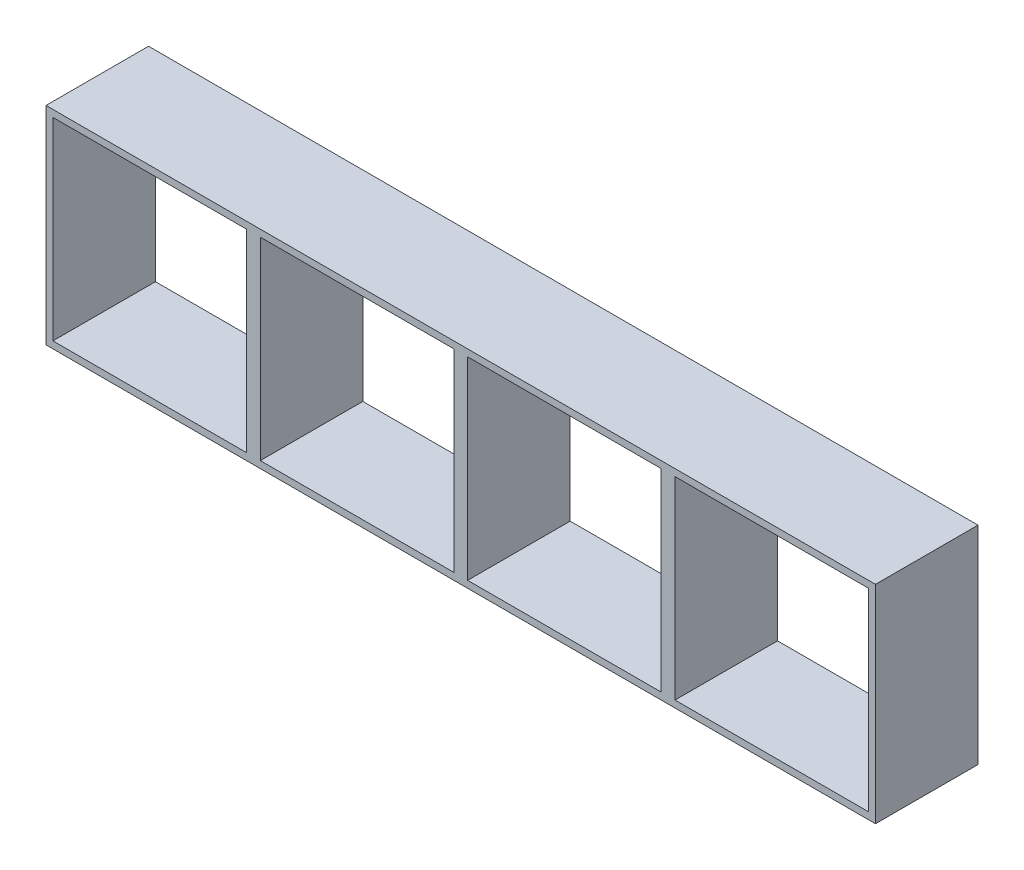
ISO-10303-21;
HEADER;
FILE_DESCRIPTION(('STEP AP214'),'2;1');
FILE_NAME('part.step','',(''),(''),'','','');
FILE_SCHEMA(('AUTOMOTIVE_DESIGN { 1 0 10303 214 1 1 1 1 }'));
ENDSEC;
DATA;
#1=APPLICATION_CONTEXT('core data for automotive mechanical design processes');
#2=APPLICATION_PROTOCOL_DEFINITION('international standard','automotive_design',2000,#1);
#3=PRODUCT_CONTEXT('',#1,'mechanical');
#4=PRODUCT('Part','Part','',(#3));
#5=PRODUCT_RELATED_PRODUCT_CATEGORY('part','',(#4));
#6=PRODUCT_DEFINITION_FORMATION('','',#4);
#7=PRODUCT_DEFINITION_CONTEXT('part definition',#1,'design');
#8=PRODUCT_DEFINITION('design','',#6,#7);
#9=PRODUCT_DEFINITION_SHAPE('','',#8);
#10=(LENGTH_UNIT() NAMED_UNIT(*) SI_UNIT(.MILLI.,.METRE.));
#11=(NAMED_UNIT(*) PLANE_ANGLE_UNIT() SI_UNIT($,.RADIAN.));
#12=(NAMED_UNIT(*) SI_UNIT($,.STERADIAN.) SOLID_ANGLE_UNIT());
#13=UNCERTAINTY_MEASURE_WITH_UNIT(LENGTH_MEASURE(1.E-05),#10,'distance_accuracy_value','');
#14=(GEOMETRIC_REPRESENTATION_CONTEXT(3) GLOBAL_UNCERTAINTY_ASSIGNED_CONTEXT((#13)) GLOBAL_UNIT_ASSIGNED_CONTEXT((#10,
#11,#12)) REPRESENTATION_CONTEXT('',''));
#15=CARTESIAN_POINT('',(0.,0.,0.));
#16=DIRECTION('',(0.,0.,1.));
#17=DIRECTION('',(1.,0.,0.));
#18=AXIS2_PLACEMENT_3D('',#15,#16,#17);
#19=CARTESIAN_POINT('',(0.,0.,14.8333333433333));
#20=DIRECTION('',(-1.,0.,0.));
#21=DIRECTION('',(0.,0.,1.));
#22=AXIS2_PLACEMENT_3D('',#19,#20,#21);
#23=PLANE('',#22);
#24=DIRECTION('',(0.,1.,0.));
#25=VECTOR('',#24,1.);
#26=CARTESIAN_POINT('',(0.,0.,0.));
#27=LINE('',#26,#25);
#28=CARTESIAN_POINT('',(0.,0.,0.));
#29=VERTEX_POINT('',#28);
#30=CARTESIAN_POINT('',(0.,30.,0.));
#31=VERTEX_POINT('',#30);
#32=EDGE_CURVE('E346',#29,#31,#27,.T.);
#33=ORIENTED_EDGE('',*,*,#32,.F.);
#34=DIRECTION('',(0.,0.,-1.));
#35=VECTOR('',#34,1.);
#36=CARTESIAN_POINT('',(0.,0.,14.8333333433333));
#37=LINE('',#36,#35);
#38=CARTESIAN_POINT('',(0.,0.,14.8333333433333));
#39=VERTEX_POINT('',#38);
#40=EDGE_CURVE('E11',#39,#29,#37,.T.);
#41=ORIENTED_EDGE('',*,*,#40,.F.);
#42=DIRECTION('',(0.,1.,0.));
#43=VECTOR('',#42,1.);
#44=CARTESIAN_POINT('',(0.,0.,14.8333333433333));
#45=LINE('',#44,#43);
#46=CARTESIAN_POINT('',(0.,30.,14.8333333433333));
#47=VERTEX_POINT('',#46);
#48=EDGE_CURVE('E206',#39,#47,#45,.T.);
#49=ORIENTED_EDGE('',*,*,#48,.T.);
#50=DIRECTION('',(0.,0.,-1.));
#51=VECTOR('',#50,1.);
#52=CARTESIAN_POINT('',(0.,30.,14.8333333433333));
#53=LINE('',#52,#51);
#54=EDGE_CURVE('E67',#47,#31,#53,.T.);
#55=ORIENTED_EDGE('',*,*,#54,.T.);
#56=EDGE_LOOP('',(#33,#41,#49,#55));
#57=FACE_BOUND('',#56,.T.);
#58=ADVANCED_FACE('F47',(#57),#23,.T.);
#59=CARTESIAN_POINT('',(0.,0.,14.8333333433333));
#60=DIRECTION('',(0.,1.,0.));
#61=DIRECTION('',(-1.,0.,0.));
#62=AXIS2_PLACEMENT_3D('',#59,#60,#61);
#63=PLANE('',#62);
#64=DIRECTION('',(1.,0.,0.));
#65=VECTOR('',#64,1.);
#66=CARTESIAN_POINT('',(0.,0.,0.));
#67=LINE('',#66,#65);
#68=CARTESIAN_POINT('',(120.,0.,0.));
#69=VERTEX_POINT('',#68);
#70=EDGE_CURVE('E212',#29,#69,#67,.T.);
#71=ORIENTED_EDGE('',*,*,#70,.T.);
#72=DIRECTION('',(0.,0.,-1.));
#73=VECTOR('',#72,1.);
#74=CARTESIAN_POINT('',(120.,0.,14.8333333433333));
#75=LINE('',#74,#73);
#76=CARTESIAN_POINT('',(120.,0.,14.8333333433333));
#77=VERTEX_POINT('',#76);
#78=EDGE_CURVE('E58',#77,#69,#75,.T.);
#79=ORIENTED_EDGE('',*,*,#78,.F.);
#80=DIRECTION('',(1.,0.,0.));
#81=VECTOR('',#80,1.);
#82=CARTESIAN_POINT('',(0.,0.,14.8333333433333));
#83=LINE('',#82,#81);
#84=EDGE_CURVE('E201',#39,#77,#83,.T.);
#85=ORIENTED_EDGE('',*,*,#84,.F.);
#86=ORIENTED_EDGE('',*,*,#40,.T.);
#87=EDGE_LOOP('',(#71,#79,#85,#86));
#88=FACE_BOUND('',#87,.T.);
#89=ADVANCED_FACE('F210',(#88),#63,.F.);
#90=CARTESIAN_POINT('',(120.,0.,14.8333333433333));
#91=DIRECTION('',(-1.,0.,0.));
#92=DIRECTION('',(0.,-1.,0.));
#93=AXIS2_PLACEMENT_3D('',#90,#91,#92);
#94=PLANE('',#93);
#95=DIRECTION('',(0.,1.,0.));
#96=VECTOR('',#95,1.);
#97=CARTESIAN_POINT('',(120.,0.,0.));
#98=LINE('',#97,#96);
#99=CARTESIAN_POINT('',(120.,30.,0.));
#100=VERTEX_POINT('',#99);
#101=EDGE_CURVE('E351',#69,#100,#98,.T.);
#102=ORIENTED_EDGE('',*,*,#101,.T.);
#103=DIRECTION('',(0.,0.,-1.));
#104=VECTOR('',#103,1.);
#105=CARTESIAN_POINT('',(120.,30.,14.8333333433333));
#106=LINE('',#105,#104);
#107=CARTESIAN_POINT('',(120.,30.,14.8333333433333));
#108=VERTEX_POINT('',#107);
#109=EDGE_CURVE('E129',#108,#100,#106,.T.);
#110=ORIENTED_EDGE('',*,*,#109,.F.);
#111=DIRECTION('',(0.,1.,0.));
#112=VECTOR('',#111,1.);
#113=CARTESIAN_POINT('',(120.,0.,14.8333333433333));
#114=LINE('',#113,#112);
#115=EDGE_CURVE('E192',#77,#108,#114,.T.);
#116=ORIENTED_EDGE('',*,*,#115,.F.);
#117=ORIENTED_EDGE('',*,*,#78,.T.);
#118=EDGE_LOOP('',(#102,#110,#116,#117));
#119=FACE_BOUND('',#118,.T.);
#120=ADVANCED_FACE('F194',(#119),#94,.F.);
#121=CARTESIAN_POINT('',(0.,1.,14.8333333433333));
#122=DIRECTION('',(0.,1.,0.));
#123=DIRECTION('',(0.,0.,1.));
#124=AXIS2_PLACEMENT_3D('',#121,#122,#123);
#125=PLANE('',#124);
#126=DIRECTION('',(1.,0.,0.));
#127=VECTOR('',#126,1.);
#128=CARTESIAN_POINT('',(0.,1.,0.));
#129=LINE('',#128,#127);
#130=CARTESIAN_POINT('',(1.,1.,0.));
#131=VERTEX_POINT('',#130);
#132=CARTESIAN_POINT('',(29.,1.,0.));
#133=VERTEX_POINT('',#132);
#134=EDGE_CURVE('E330',#131,#133,#129,.T.);
#135=ORIENTED_EDGE('',*,*,#134,.F.);
#136=DIRECTION('',(0.,0.,-1.));
#137=VECTOR('',#136,1.);
#138=CARTESIAN_POINT('',(1.,1.,14.8333333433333));
#139=LINE('',#138,#137);
#140=CARTESIAN_POINT('',(1.,1.,14.8333333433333));
#141=VERTEX_POINT('',#140);
#142=EDGE_CURVE('E229',#141,#131,#139,.T.);
#143=ORIENTED_EDGE('',*,*,#142,.F.);
#144=DIRECTION('',(1.,0.,0.));
#145=VECTOR('',#144,1.);
#146=CARTESIAN_POINT('',(0.,1.,14.8333333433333));
#147=LINE('',#146,#145);
#148=CARTESIAN_POINT('',(29.,1.,14.8333333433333));
#149=VERTEX_POINT('',#148);
#150=EDGE_CURVE('E403',#141,#149,#147,.T.);
#151=ORIENTED_EDGE('',*,*,#150,.T.);
#152=DIRECTION('',(0.,0.,-1.));
#153=VECTOR('',#152,1.);
#154=CARTESIAN_POINT('',(29.,1.,14.8333333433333));
#155=LINE('',#154,#153);
#156=EDGE_CURVE('E219',#149,#133,#155,.T.);
#157=ORIENTED_EDGE('',*,*,#156,.T.);
#158=EDGE_LOOP('',(#135,#143,#151,#157));
#159=FACE_BOUND('',#158,.T.);
#160=ADVANCED_FACE('F457',(#159),#125,.T.);
#161=CARTESIAN_POINT('',(1.,0.,14.8333333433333));
#162=DIRECTION('',(1.,0.,0.));
#163=DIRECTION('',(0.,1.,0.));
#164=AXIS2_PLACEMENT_3D('',#161,#162,#163);
#165=PLANE('',#164);
#166=DIRECTION('',(0.,-1.,0.));
#167=VECTOR('',#166,1.);
#168=CARTESIAN_POINT('',(1.,0.,0.));
#169=LINE('',#168,#167);
#170=CARTESIAN_POINT('',(1.,29.,0.));
#171=VERTEX_POINT('',#170);
#172=EDGE_CURVE('E334',#171,#131,#169,.T.);
#173=ORIENTED_EDGE('',*,*,#172,.F.);
#174=DIRECTION('',(0.,0.,-1.));
#175=VECTOR('',#174,1.);
#176=CARTESIAN_POINT('',(1.,29.,14.8333333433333));
#177=LINE('',#176,#175);
#178=CARTESIAN_POINT('',(1.,29.,14.8333333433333));
#179=VERTEX_POINT('',#178);
#180=EDGE_CURVE('E226',#179,#171,#177,.T.);
#181=ORIENTED_EDGE('',*,*,#180,.F.);
#182=DIRECTION('',(0.,-1.,0.));
#183=VECTOR('',#182,1.);
#184=CARTESIAN_POINT('',(1.,0.,14.8333333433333));
#185=LINE('',#184,#183);
#186=EDGE_CURVE('E407',#179,#141,#185,.T.);
#187=ORIENTED_EDGE('',*,*,#186,.T.);
#188=ORIENTED_EDGE('',*,*,#142,.T.);
#189=EDGE_LOOP('',(#173,#181,#187,#188));
#190=FACE_BOUND('',#189,.T.);
#191=ADVANCED_FACE('F453',(#190),#165,.T.);
#192=CARTESIAN_POINT('',(0.,29.,14.8333333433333));
#193=DIRECTION('',(0.,-1.,0.));
#194=DIRECTION('',(1.,0.,0.));
#195=AXIS2_PLACEMENT_3D('',#192,#193,#194);
#196=PLANE('',#195);
#197=DIRECTION('',(-1.,0.,0.));
#198=VECTOR('',#197,1.);
#199=CARTESIAN_POINT('',(0.,29.,0.));
#200=LINE('',#199,#198);
#201=CARTESIAN_POINT('',(29.,29.,0.));
#202=VERTEX_POINT('',#201);
#203=EDGE_CURVE('E338',#202,#171,#200,.T.);
#204=ORIENTED_EDGE('',*,*,#203,.F.);
#205=DIRECTION('',(0.,0.,-1.));
#206=VECTOR('',#205,1.);
#207=CARTESIAN_POINT('',(29.,29.,14.8333333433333));
#208=LINE('',#207,#206);
#209=CARTESIAN_POINT('',(29.,29.,14.8333333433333));
#210=VERTEX_POINT('',#209);
#211=EDGE_CURVE('E222',#210,#202,#208,.T.);
#212=ORIENTED_EDGE('',*,*,#211,.F.);
#213=DIRECTION('',(-1.,0.,0.));
#214=VECTOR('',#213,1.);
#215=CARTESIAN_POINT('',(0.,29.,14.8333333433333));
#216=LINE('',#215,#214);
#217=EDGE_CURVE('E411',#210,#179,#216,.T.);
#218=ORIENTED_EDGE('',*,*,#217,.T.);
#219=ORIENTED_EDGE('',*,*,#180,.T.);
#220=EDGE_LOOP('',(#204,#212,#218,#219));
#221=FACE_BOUND('',#220,.T.);
#222=ADVANCED_FACE('F449',(#221),#196,.T.);
#223=CARTESIAN_POINT('',(0.,0.999999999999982,14.8333333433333));
#224=DIRECTION('',(0.,1.,0.));
#225=DIRECTION('',(-1.,0.,0.));
#226=AXIS2_PLACEMENT_3D('',#223,#224,#225);
#227=PLANE('',#226);
#228=DIRECTION('',(1.,0.,0.));
#229=VECTOR('',#228,1.);
#230=CARTESIAN_POINT('',(0.,0.999999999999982,0.));
#231=LINE('',#230,#229);
#232=CARTESIAN_POINT('',(91.,1.00000000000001,0.));
#233=VERTEX_POINT('',#232);
#234=CARTESIAN_POINT('',(119.,1.00000000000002,0.));
#235=VERTEX_POINT('',#234);
#236=EDGE_CURVE('E314',#233,#235,#231,.T.);
#237=ORIENTED_EDGE('',*,*,#236,.F.);
#238=DIRECTION('',(0.,0.,-1.));
#239=VECTOR('',#238,1.);
#240=CARTESIAN_POINT('',(91.,1.00000000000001,14.8333333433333));
#241=LINE('',#240,#239);
#242=CARTESIAN_POINT('',(91.,1.00000000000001,14.8333333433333));
#243=VERTEX_POINT('',#242);
#244=EDGE_CURVE('E223',#243,#233,#241,.T.);
#245=ORIENTED_EDGE('',*,*,#244,.F.);
#246=DIRECTION('',(1.,0.,0.));
#247=VECTOR('',#246,1.);
#248=CARTESIAN_POINT('',(0.,0.999999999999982,14.8333333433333));
#249=LINE('',#248,#247);
#250=CARTESIAN_POINT('',(119.,1.00000000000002,14.8333333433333));
#251=VERTEX_POINT('',#250);
#252=EDGE_CURVE('E388',#243,#251,#249,.T.);
#253=ORIENTED_EDGE('',*,*,#252,.T.);
#254=DIRECTION('',(0.,0.,-1.));
#255=VECTOR('',#254,1.);
#256=CARTESIAN_POINT('',(119.,1.00000000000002,14.8333333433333));
#257=LINE('',#256,#255);
#258=EDGE_CURVE('E232',#251,#235,#257,.T.);
#259=ORIENTED_EDGE('',*,*,#258,.T.);
#260=EDGE_LOOP('',(#237,#245,#253,#259));
#261=FACE_BOUND('',#260,.T.);
#262=ADVANCED_FACE('F452',(#261),#227,.T.);
#263=CARTESIAN_POINT('',(91.,0.,14.8333333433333));
#264=DIRECTION('',(-1.,0.,0.));
#265=DIRECTION('',(0.,0.,1.));
#266=AXIS2_PLACEMENT_3D('',#263,#264,#265);
#267=PLANE('',#266);
#268=DIRECTION('',(0.,1.,0.));
#269=VECTOR('',#268,1.);
#270=CARTESIAN_POINT('',(91.,0.,0.));
#271=LINE('',#270,#269);
#272=CARTESIAN_POINT('',(91.,29.,0.));
#273=VERTEX_POINT('',#272);
#274=EDGE_CURVE('E318',#233,#273,#271,.T.);
#275=ORIENTED_EDGE('',*,*,#274,.T.);
#276=DIRECTION('',(0.,0.,-1.));
#277=VECTOR('',#276,1.);
#278=CARTESIAN_POINT('',(91.,29.,14.8333333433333));
#279=LINE('',#278,#277);
#280=CARTESIAN_POINT('',(91.,29.,14.8333333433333));
#281=VERTEX_POINT('',#280);
#282=EDGE_CURVE('E240',#281,#273,#279,.T.);
#283=ORIENTED_EDGE('',*,*,#282,.F.);
#284=DIRECTION('',(0.,1.,0.));
#285=VECTOR('',#284,1.);
#286=CARTESIAN_POINT('',(91.,0.,14.8333333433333));
#287=LINE('',#286,#285);
#288=EDGE_CURVE('E392',#243,#281,#287,.T.);
#289=ORIENTED_EDGE('',*,*,#288,.F.);
#290=ORIENTED_EDGE('',*,*,#244,.T.);
#291=EDGE_LOOP('',(#275,#283,#289,#290));
#292=FACE_BOUND('',#291,.T.);
#293=ADVANCED_FACE('F469',(#292),#267,.F.);
#294=CARTESIAN_POINT('',(0.,29.,14.8333333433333));
#295=DIRECTION('',(0.,1.,0.));
#296=DIRECTION('',(-1.,0.,0.));
#297=AXIS2_PLACEMENT_3D('',#294,#295,#296);
#298=PLANE('',#297);
#299=DIRECTION('',(1.,0.,0.));
#300=VECTOR('',#299,1.);
#301=CARTESIAN_POINT('',(0.,29.,0.));
#302=LINE('',#301,#300);
#303=CARTESIAN_POINT('',(119.,29.,0.));
#304=VERTEX_POINT('',#303);
#305=EDGE_CURVE('E322',#273,#304,#302,.T.);
#306=ORIENTED_EDGE('',*,*,#305,.T.);
#307=DIRECTION('',(0.,0.,-1.));
#308=VECTOR('',#307,1.);
#309=CARTESIAN_POINT('',(119.,29.,14.8333333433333));
#310=LINE('',#309,#308);
#311=CARTESIAN_POINT('',(119.,29.,14.8333333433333));
#312=VERTEX_POINT('',#311);
#313=EDGE_CURVE('E235',#312,#304,#310,.T.);
#314=ORIENTED_EDGE('',*,*,#313,.F.);
#315=DIRECTION('',(1.,0.,0.));
#316=VECTOR('',#315,1.);
#317=CARTESIAN_POINT('',(0.,29.,14.8333333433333));
#318=LINE('',#317,#316);
#319=EDGE_CURVE('E396',#281,#312,#318,.T.);
#320=ORIENTED_EDGE('',*,*,#319,.F.);
#321=ORIENTED_EDGE('',*,*,#282,.T.);
#322=EDGE_LOOP('',(#306,#314,#320,#321));
#323=FACE_BOUND('',#322,.T.);
#324=ADVANCED_FACE('F465',(#323),#298,.F.);
#325=CARTESIAN_POINT('',(0.,0.999999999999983,14.8333333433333));
#326=DIRECTION('',(0.,1.,0.));
#327=DIRECTION('',(-1.,0.,0.));
#328=AXIS2_PLACEMENT_3D('',#325,#326,#327);
#329=PLANE('',#328);
#330=DIRECTION('',(1.,0.,0.));
#331=VECTOR('',#330,1.);
#332=CARTESIAN_POINT('',(0.,0.999999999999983,0.));
#333=LINE('',#332,#331);
#334=CARTESIAN_POINT('',(61.,1.,0.));
#335=VERTEX_POINT('',#334);
#336=CARTESIAN_POINT('',(89.,1.00000000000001,0.));
#337=VERTEX_POINT('',#336);
#338=EDGE_CURVE('E298',#335,#337,#333,.T.);
#339=ORIENTED_EDGE('',*,*,#338,.F.);
#340=DIRECTION('',(0.,0.,-1.));
#341=VECTOR('',#340,1.);
#342=CARTESIAN_POINT('',(61.,1.,14.8333333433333));
#343=LINE('',#342,#341);
#344=CARTESIAN_POINT('',(61.,1.,14.8333333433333));
#345=VERTEX_POINT('',#344);
#346=EDGE_CURVE('E236',#345,#335,#343,.T.);
#347=ORIENTED_EDGE('',*,*,#346,.F.);
#348=DIRECTION('',(1.,0.,0.));
#349=VECTOR('',#348,1.);
#350=CARTESIAN_POINT('',(0.,0.999999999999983,14.8333333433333));
#351=LINE('',#350,#349);
#352=CARTESIAN_POINT('',(89.,1.00000000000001,14.8333333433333));
#353=VERTEX_POINT('',#352);
#354=EDGE_CURVE('E373',#345,#353,#351,.T.);
#355=ORIENTED_EDGE('',*,*,#354,.T.);
#356=DIRECTION('',(0.,0.,-1.));
#357=VECTOR('',#356,1.);
#358=CARTESIAN_POINT('',(89.,1.00000000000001,14.8333333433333));
#359=LINE('',#358,#357);
#360=EDGE_CURVE('E246',#353,#337,#359,.T.);
#361=ORIENTED_EDGE('',*,*,#360,.T.);
#362=EDGE_LOOP('',(#339,#347,#355,#361));
#363=FACE_BOUND('',#362,.T.);
#364=ADVANCED_FACE('F468',(#363),#329,.T.);
#365=CARTESIAN_POINT('',(61.,0.,14.8333333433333));
#366=DIRECTION('',(-1.,0.,0.));
#367=DIRECTION('',(0.,-1.,0.));
#368=AXIS2_PLACEMENT_3D('',#365,#366,#367);
#369=PLANE('',#368);
#370=DIRECTION('',(0.,1.,0.));
#371=VECTOR('',#370,1.);
#372=CARTESIAN_POINT('',(61.,0.,0.));
#373=LINE('',#372,#371);
#374=CARTESIAN_POINT('',(61.,29.,0.));
#375=VERTEX_POINT('',#374);
#376=EDGE_CURVE('E302',#335,#375,#373,.T.);
#377=ORIENTED_EDGE('',*,*,#376,.T.);
#378=DIRECTION('',(0.,0.,-1.));
#379=VECTOR('',#378,1.);
#380=CARTESIAN_POINT('',(61.,29.,14.8333333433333));
#381=LINE('',#380,#379);
#382=CARTESIAN_POINT('',(61.,29.,14.8333333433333));
#383=VERTEX_POINT('',#382);
#384=EDGE_CURVE('E253',#383,#375,#381,.T.);
#385=ORIENTED_EDGE('',*,*,#384,.F.);
#386=DIRECTION('',(0.,1.,0.));
#387=VECTOR('',#386,1.);
#388=CARTESIAN_POINT('',(61.,0.,14.8333333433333));
#389=LINE('',#388,#387);
#390=EDGE_CURVE('E377',#345,#383,#389,.T.);
#391=ORIENTED_EDGE('',*,*,#390,.F.);
#392=ORIENTED_EDGE('',*,*,#346,.T.);
#393=EDGE_LOOP('',(#377,#385,#391,#392));
#394=FACE_BOUND('',#393,.T.);
#395=ADVANCED_FACE('F483',(#394),#369,.F.);
#396=CARTESIAN_POINT('',(0.,29.,14.8333333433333));
#397=DIRECTION('',(0.,1.,0.));
#398=DIRECTION('',(0.,0.,1.));
#399=AXIS2_PLACEMENT_3D('',#396,#397,#398);
#400=PLANE('',#399);
#401=DIRECTION('',(1.,0.,0.));
#402=VECTOR('',#401,1.);
#403=CARTESIAN_POINT('',(0.,29.,0.));
#404=LINE('',#403,#402);
#405=CARTESIAN_POINT('',(89.,29.,0.));
#406=VERTEX_POINT('',#405);
#407=EDGE_CURVE('E306',#375,#406,#404,.T.);
#408=ORIENTED_EDGE('',*,*,#407,.T.);
#409=DIRECTION('',(0.,0.,-1.));
#410=VECTOR('',#409,1.);
#411=CARTESIAN_POINT('',(89.,29.,14.8333333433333));
#412=LINE('',#411,#410);
#413=CARTESIAN_POINT('',(89.,29.,14.8333333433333));
#414=VERTEX_POINT('',#413);
#415=EDGE_CURVE('E249',#414,#406,#412,.T.);
#416=ORIENTED_EDGE('',*,*,#415,.F.);
#417=DIRECTION('',(1.,0.,0.));
#418=VECTOR('',#417,1.);
#419=CARTESIAN_POINT('',(0.,29.,14.8333333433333));
#420=LINE('',#419,#418);
#421=EDGE_CURVE('E381',#383,#414,#420,.T.);
#422=ORIENTED_EDGE('',*,*,#421,.F.);
#423=ORIENTED_EDGE('',*,*,#384,.T.);
#424=EDGE_LOOP('',(#408,#416,#422,#423));
#425=FACE_BOUND('',#424,.T.);
#426=ADVANCED_FACE('F480',(#425),#400,.F.);
#427=CARTESIAN_POINT('',(0.,1.,14.8333333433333));
#428=DIRECTION('',(0.,1.,0.));
#429=DIRECTION('',(-1.,0.,0.));
#430=AXIS2_PLACEMENT_3D('',#427,#428,#429);
#431=PLANE('',#430);
#432=DIRECTION('',(1.,0.,0.));
#433=VECTOR('',#432,1.);
#434=CARTESIAN_POINT('',(0.,1.,0.));
#435=LINE('',#434,#433);
#436=CARTESIAN_POINT('',(31.,1.,0.));
#437=VERTEX_POINT('',#436);
#438=CARTESIAN_POINT('',(59.,1.,0.));
#439=VERTEX_POINT('',#438);
#440=EDGE_CURVE('E280',#437,#439,#435,.T.);
#441=ORIENTED_EDGE('',*,*,#440,.F.);
#442=DIRECTION('',(0.,0.,-1.));
#443=VECTOR('',#442,1.);
#444=CARTESIAN_POINT('',(31.,1.,14.8333333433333));
#445=LINE('',#444,#443);
#446=CARTESIAN_POINT('',(31.,1.,14.8333333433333));
#447=VERTEX_POINT('',#446);
#448=EDGE_CURVE('E51',#447,#437,#445,.T.);
#449=ORIENTED_EDGE('',*,*,#448,.F.);
#450=DIRECTION('',(1.,0.,0.));
#451=VECTOR('',#450,1.);
#452=CARTESIAN_POINT('',(0.,1.,14.8333333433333));
#453=LINE('',#452,#451);
#454=CARTESIAN_POINT('',(59.,1.,14.8333333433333));
#455=VERTEX_POINT('',#454);
#456=EDGE_CURVE('E357',#447,#455,#453,.T.);
#457=ORIENTED_EDGE('',*,*,#456,.T.);
#458=DIRECTION('',(0.,0.,-1.));
#459=VECTOR('',#458,1.);
#460=CARTESIAN_POINT('',(59.,1.,14.8333333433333));
#461=LINE('',#460,#459);
#462=EDGE_CURVE('E259',#455,#439,#461,.T.);
#463=ORIENTED_EDGE('',*,*,#462,.T.);
#464=EDGE_LOOP('',(#441,#449,#457,#463));
#465=FACE_BOUND('',#464,.T.);
#466=ADVANCED_FACE('F49',(#465),#431,.T.);
#467=CARTESIAN_POINT('',(31.,0.,14.8333333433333));
#468=DIRECTION('',(1.,0.,0.));
#469=DIRECTION('',(0.,1.,0.));
#470=AXIS2_PLACEMENT_3D('',#467,#468,#469);
#471=PLANE('',#470);
#472=DIRECTION('',(0.,-1.,0.));
#473=VECTOR('',#472,1.);
#474=CARTESIAN_POINT('',(31.,0.,0.));
#475=LINE('',#474,#473);
#476=CARTESIAN_POINT('',(31.,29.,0.));
#477=VERTEX_POINT('',#476);
#478=EDGE_CURVE('E275',#477,#437,#475,.T.);
#479=ORIENTED_EDGE('',*,*,#478,.F.);
#480=DIRECTION('',(0.,0.,-1.));
#481=VECTOR('',#480,1.);
#482=CARTESIAN_POINT('',(31.,29.,14.8333333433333));
#483=LINE('',#482,#481);
#484=CARTESIAN_POINT('',(31.,29.,14.8333333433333));
#485=VERTEX_POINT('',#484);
#486=EDGE_CURVE('E264',#485,#477,#483,.T.);
#487=ORIENTED_EDGE('',*,*,#486,.F.);
#488=DIRECTION('',(0.,-1.,0.));
#489=VECTOR('',#488,1.);
#490=CARTESIAN_POINT('',(31.,0.,14.8333333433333));
#491=LINE('',#490,#489);
#492=EDGE_CURVE('E278',#485,#447,#491,.T.);
#493=ORIENTED_EDGE('',*,*,#492,.T.);
#494=ORIENTED_EDGE('',*,*,#448,.T.);
#495=EDGE_LOOP('',(#479,#487,#493,#494));
#496=FACE_BOUND('',#495,.T.);
#497=ADVANCED_FACE('F273',(#496),#471,.T.);
#498=CARTESIAN_POINT('',(0.,29.,14.8333333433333));
#499=DIRECTION('',(0.,-1.,0.));
#500=DIRECTION('',(1.,0.,0.));
#501=AXIS2_PLACEMENT_3D('',#498,#499,#500);
#502=PLANE('',#501);
#503=DIRECTION('',(-1.,0.,0.));
#504=VECTOR('',#503,1.);
#505=CARTESIAN_POINT('',(0.,29.,0.));
#506=LINE('',#505,#504);
#507=CARTESIAN_POINT('',(59.,29.,0.));
#508=VERTEX_POINT('',#507);
#509=EDGE_CURVE('E288',#508,#477,#506,.T.);
#510=ORIENTED_EDGE('',*,*,#509,.F.);
#511=DIRECTION('',(0.,0.,-1.));
#512=VECTOR('',#511,1.);
#513=CARTESIAN_POINT('',(59.,29.,14.8333333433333));
#514=LINE('',#513,#512);
#515=CARTESIAN_POINT('',(59.,29.,14.8333333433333));
#516=VERTEX_POINT('',#515);
#517=EDGE_CURVE('E262',#516,#508,#514,.T.);
#518=ORIENTED_EDGE('',*,*,#517,.F.);
#519=DIRECTION('',(-1.,0.,0.));
#520=VECTOR('',#519,1.);
#521=CARTESIAN_POINT('',(0.,29.,14.8333333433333));
#522=LINE('',#521,#520);
#523=EDGE_CURVE('E364',#516,#485,#522,.T.);
#524=ORIENTED_EDGE('',*,*,#523,.T.);
#525=ORIENTED_EDGE('',*,*,#486,.T.);
#526=EDGE_LOOP('',(#510,#518,#524,#525));
#527=FACE_BOUND('',#526,.T.);
#528=ADVANCED_FACE('F447',(#527),#502,.T.);
#529=CARTESIAN_POINT('',(29.,0.,14.8333333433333));
#530=DIRECTION('',(-1.,0.,0.));
#531=DIRECTION('',(0.,0.,1.));
#532=AXIS2_PLACEMENT_3D('',#529,#530,#531);
#533=PLANE('',#532);
#534=DIRECTION('',(0.,1.,0.));
#535=VECTOR('',#534,1.);
#536=CARTESIAN_POINT('',(29.,0.,0.));
#537=LINE('',#536,#535);
#538=EDGE_CURVE('E342',#133,#202,#537,.T.);
#539=ORIENTED_EDGE('',*,*,#538,.F.);
#540=ORIENTED_EDGE('',*,*,#156,.F.);
#541=DIRECTION('',(0.,1.,0.));
#542=VECTOR('',#541,1.);
#543=CARTESIAN_POINT('',(29.,0.,14.8333333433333));
#544=LINE('',#543,#542);
#545=EDGE_CURVE('E415',#149,#210,#544,.T.);
#546=ORIENTED_EDGE('',*,*,#545,.T.);
#547=ORIENTED_EDGE('',*,*,#211,.T.);
#548=EDGE_LOOP('',(#539,#540,#546,#547));
#549=FACE_BOUND('',#548,.T.);
#550=ADVANCED_FACE('F443',(#549),#533,.T.);
#551=CARTESIAN_POINT('',(119.,0.,14.8333333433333));
#552=DIRECTION('',(1.,0.,0.));
#553=DIRECTION('',(0.,1.,0.));
#554=AXIS2_PLACEMENT_3D('',#551,#552,#553);
#555=PLANE('',#554);
#556=DIRECTION('',(0.,-1.,0.));
#557=VECTOR('',#556,1.);
#558=CARTESIAN_POINT('',(119.,0.,0.));
#559=LINE('',#558,#557);
#560=EDGE_CURVE('E326',#304,#235,#559,.T.);
#561=ORIENTED_EDGE('',*,*,#560,.T.);
#562=ORIENTED_EDGE('',*,*,#258,.F.);
#563=DIRECTION('',(0.,-1.,0.));
#564=VECTOR('',#563,1.);
#565=CARTESIAN_POINT('',(119.,0.,14.8333333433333));
#566=LINE('',#565,#564);
#567=EDGE_CURVE('E400',#312,#251,#566,.T.);
#568=ORIENTED_EDGE('',*,*,#567,.F.);
#569=ORIENTED_EDGE('',*,*,#313,.T.);
#570=EDGE_LOOP('',(#561,#562,#568,#569));
#571=FACE_BOUND('',#570,.T.);
#572=ADVANCED_FACE('F446',(#571),#555,.F.);
#573=CARTESIAN_POINT('',(89.,0.,14.8333333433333));
#574=DIRECTION('',(1.,0.,0.));
#575=DIRECTION('',(0.,0.,-1.));
#576=AXIS2_PLACEMENT_3D('',#573,#574,#575);
#577=PLANE('',#576);
#578=DIRECTION('',(0.,-1.,0.));
#579=VECTOR('',#578,1.);
#580=CARTESIAN_POINT('',(89.,0.,0.));
#581=LINE('',#580,#579);
#582=EDGE_CURVE('E310',#406,#337,#581,.T.);
#583=ORIENTED_EDGE('',*,*,#582,.T.);
#584=ORIENTED_EDGE('',*,*,#360,.F.);
#585=DIRECTION('',(0.,-1.,0.));
#586=VECTOR('',#585,1.);
#587=CARTESIAN_POINT('',(89.,0.,14.8333333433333));
#588=LINE('',#587,#586);
#589=EDGE_CURVE('E385',#414,#353,#588,.T.);
#590=ORIENTED_EDGE('',*,*,#589,.F.);
#591=ORIENTED_EDGE('',*,*,#415,.T.);
#592=EDGE_LOOP('',(#583,#584,#590,#591));
#593=FACE_BOUND('',#592,.T.);
#594=ADVANCED_FACE('F431',(#593),#577,.F.);
#595=CARTESIAN_POINT('',(59.,0.,14.8333333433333));
#596=DIRECTION('',(-1.,0.,0.));
#597=DIRECTION('',(0.,0.,1.));
#598=AXIS2_PLACEMENT_3D('',#595,#596,#597);
#599=PLANE('',#598);
#600=DIRECTION('',(0.,1.,0.));
#601=VECTOR('',#600,1.);
#602=CARTESIAN_POINT('',(59.,0.,0.));
#603=LINE('',#602,#601);
#604=EDGE_CURVE('E292',#439,#508,#603,.T.);
#605=ORIENTED_EDGE('',*,*,#604,.F.);
#606=ORIENTED_EDGE('',*,*,#462,.F.);
#607=DIRECTION('',(0.,1.,0.));
#608=VECTOR('',#607,1.);
#609=CARTESIAN_POINT('',(59.,0.,14.8333333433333));
#610=LINE('',#609,#608);
#611=EDGE_CURVE('E369',#455,#516,#610,.T.);
#612=ORIENTED_EDGE('',*,*,#611,.T.);
#613=ORIENTED_EDGE('',*,*,#517,.T.);
#614=EDGE_LOOP('',(#605,#606,#612,#613));
#615=FACE_BOUND('',#614,.T.);
#616=ADVANCED_FACE('F423',(#615),#599,.T.);
#617=CARTESIAN_POINT('',(0.,30.,14.8333333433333));
#618=DIRECTION('',(0.,1.,0.));
#619=DIRECTION('',(-1.,0.,0.));
#620=AXIS2_PLACEMENT_3D('',#617,#618,#619);
#621=PLANE('',#620);
#622=DIRECTION('',(1.,0.,0.));
#623=VECTOR('',#622,1.);
#624=CARTESIAN_POINT('',(0.,30.,0.));
#625=LINE('',#624,#623);
#626=EDGE_CURVE('E354',#31,#100,#625,.T.);
#627=ORIENTED_EDGE('',*,*,#626,.F.);
#628=ORIENTED_EDGE('',*,*,#54,.F.);
#629=DIRECTION('',(1.,0.,0.));
#630=VECTOR('',#629,1.);
#631=CARTESIAN_POINT('',(0.,30.,14.8333333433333));
#632=LINE('',#631,#630);
#633=EDGE_CURVE('E200',#47,#108,#632,.T.);
#634=ORIENTED_EDGE('',*,*,#633,.T.);
#635=ORIENTED_EDGE('',*,*,#109,.T.);
#636=EDGE_LOOP('',(#627,#628,#634,#635));
#637=FACE_BOUND('',#636,.T.);
#638=ADVANCED_FACE('F421',(#637),#621,.T.);
#639=CARTESIAN_POINT('',(0.,0.,14.8333333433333));
#640=DIRECTION('',(0.,0.,1.));
#641=DIRECTION('',(1.,0.,0.));
#642=AXIS2_PLACEMENT_3D('',#639,#640,#641);
#643=PLANE('',#642);
#644=ORIENTED_EDGE('',*,*,#456,.F.);
#645=ORIENTED_EDGE('',*,*,#492,.F.);
#646=ORIENTED_EDGE('',*,*,#523,.F.);
#647=ORIENTED_EDGE('',*,*,#611,.F.);
#648=EDGE_LOOP('',(#644,#645,#646,#647));
#649=FACE_BOUND('',#648,.T.);
#650=ORIENTED_EDGE('',*,*,#354,.F.);
#651=ORIENTED_EDGE('',*,*,#390,.T.);
#652=ORIENTED_EDGE('',*,*,#421,.T.);
#653=ORIENTED_EDGE('',*,*,#589,.T.);
#654=EDGE_LOOP('',(#650,#651,#652,#653));
#655=FACE_BOUND('',#654,.T.);
#656=ORIENTED_EDGE('',*,*,#252,.F.);
#657=ORIENTED_EDGE('',*,*,#288,.T.);
#658=ORIENTED_EDGE('',*,*,#319,.T.);
#659=ORIENTED_EDGE('',*,*,#567,.T.);
#660=EDGE_LOOP('',(#656,#657,#658,#659));
#661=FACE_BOUND('',#660,.T.);
#662=ORIENTED_EDGE('',*,*,#150,.F.);
#663=ORIENTED_EDGE('',*,*,#186,.F.);
#664=ORIENTED_EDGE('',*,*,#217,.F.);
#665=ORIENTED_EDGE('',*,*,#545,.F.);
#666=EDGE_LOOP('',(#662,#663,#664,#665));
#667=FACE_BOUND('',#666,.T.);
#668=ORIENTED_EDGE('',*,*,#48,.F.);
#669=ORIENTED_EDGE('',*,*,#84,.T.);
#670=ORIENTED_EDGE('',*,*,#115,.T.);
#671=ORIENTED_EDGE('',*,*,#633,.F.);
#672=EDGE_LOOP('',(#668,#669,#670,#671));
#673=FACE_BOUND('',#672,.T.);
#674=ADVANCED_FACE('F205',(#649,#655,#661,#667,#673),#643,.T.);
#675=CARTESIAN_POINT('',(0.,0.,0.));
#676=DIRECTION('',(0.,0.,1.));
#677=DIRECTION('',(1.,0.,0.));
#678=AXIS2_PLACEMENT_3D('',#675,#676,#677);
#679=PLANE('',#678);
#680=ORIENTED_EDGE('',*,*,#440,.T.);
#681=ORIENTED_EDGE('',*,*,#604,.T.);
#682=ORIENTED_EDGE('',*,*,#509,.T.);
#683=ORIENTED_EDGE('',*,*,#478,.T.);
#684=EDGE_LOOP('',(#680,#681,#682,#683));
#685=FACE_BOUND('',#684,.T.);
#686=ORIENTED_EDGE('',*,*,#338,.T.);
#687=ORIENTED_EDGE('',*,*,#582,.F.);
#688=ORIENTED_EDGE('',*,*,#407,.F.);
#689=ORIENTED_EDGE('',*,*,#376,.F.);
#690=EDGE_LOOP('',(#686,#687,#688,#689));
#691=FACE_BOUND('',#690,.T.);
#692=ORIENTED_EDGE('',*,*,#236,.T.);
#693=ORIENTED_EDGE('',*,*,#560,.F.);
#694=ORIENTED_EDGE('',*,*,#305,.F.);
#695=ORIENTED_EDGE('',*,*,#274,.F.);
#696=EDGE_LOOP('',(#692,#693,#694,#695));
#697=FACE_BOUND('',#696,.T.);
#698=ORIENTED_EDGE('',*,*,#134,.T.);
#699=ORIENTED_EDGE('',*,*,#538,.T.);
#700=ORIENTED_EDGE('',*,*,#203,.T.);
#701=ORIENTED_EDGE('',*,*,#172,.T.);
#702=EDGE_LOOP('',(#698,#699,#700,#701));
#703=FACE_BOUND('',#702,.T.);
#704=ORIENTED_EDGE('',*,*,#32,.T.);
#705=ORIENTED_EDGE('',*,*,#626,.T.);
#706=ORIENTED_EDGE('',*,*,#101,.F.);
#707=ORIENTED_EDGE('',*,*,#70,.F.);
#708=EDGE_LOOP('',(#704,#705,#706,#707));
#709=FACE_BOUND('',#708,.T.);
#710=ADVANCED_FACE('F286',(#685,#691,#697,#703,#709),#679,.F.);
#711=CLOSED_SHELL('',(#58,#89,#120,#160,#191,#222,#262,#293,#324,#364,#395,#426,#466,#497,#528,
#550,#572,#594,#616,#638,#674,#710));
#712=MANIFOLD_SOLID_BREP('B2',#711);
#713=ADVANCED_BREP_SHAPE_REPRESENTATION('',(#18,#712),#14);
#714=SHAPE_DEFINITION_REPRESENTATION(#9,#713);
ENDSEC;
END-ISO-10303-21;
